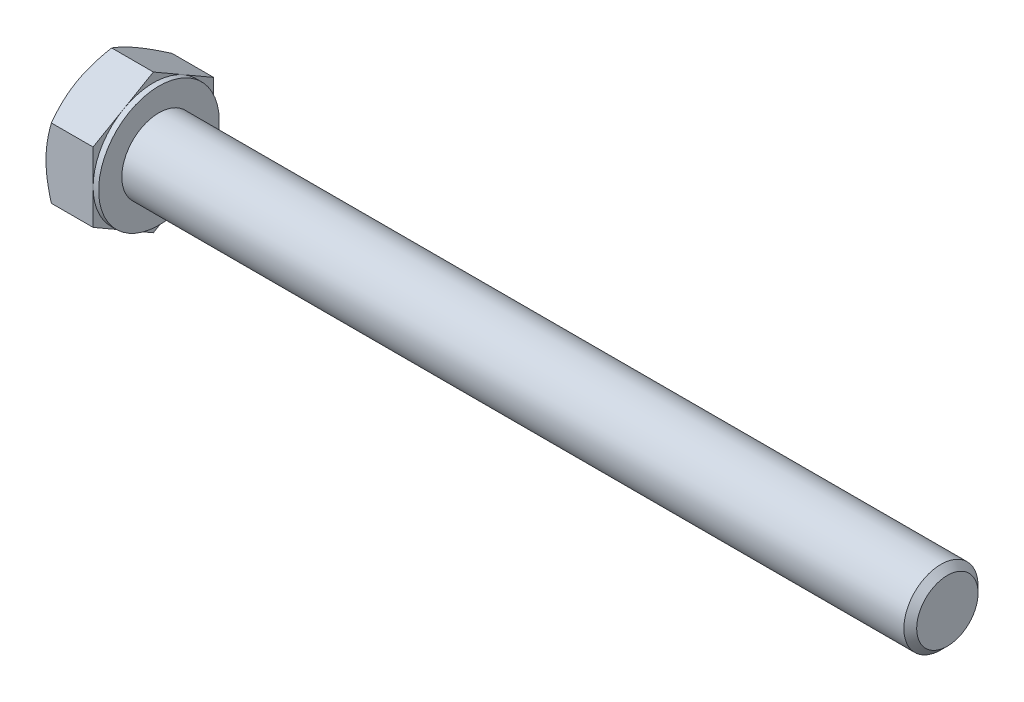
ISO-10303-21;
HEADER;
FILE_DESCRIPTION(('STEP AP214'),'2;1');
FILE_NAME('part.step','',(''),(''),'','','');
FILE_SCHEMA(('AUTOMOTIVE_DESIGN { 1 0 10303 214 1 1 1 1 }'));
ENDSEC;
DATA;
#1=APPLICATION_CONTEXT('core data for automotive mechanical design processes');
#2=APPLICATION_PROTOCOL_DEFINITION('international standard','automotive_design',2000,#1);
#3=PRODUCT_CONTEXT('',#1,'mechanical');
#4=PRODUCT('Part','Part','',(#3));
#5=PRODUCT_RELATED_PRODUCT_CATEGORY('part','',(#4));
#6=PRODUCT_DEFINITION_FORMATION('','',#4);
#7=PRODUCT_DEFINITION_CONTEXT('part definition',#1,'design');
#8=PRODUCT_DEFINITION('design','',#6,#7);
#9=PRODUCT_DEFINITION_SHAPE('','',#8);
#10=(LENGTH_UNIT() NAMED_UNIT(*) SI_UNIT(.MILLI.,.METRE.));
#11=(NAMED_UNIT(*) PLANE_ANGLE_UNIT() SI_UNIT($,.RADIAN.));
#12=(NAMED_UNIT(*) SI_UNIT($,.STERADIAN.) SOLID_ANGLE_UNIT());
#13=UNCERTAINTY_MEASURE_WITH_UNIT(LENGTH_MEASURE(1.E-05),#10,'distance_accuracy_value','');
#14=(GEOMETRIC_REPRESENTATION_CONTEXT(3) GLOBAL_UNCERTAINTY_ASSIGNED_CONTEXT((#13)) GLOBAL_UNIT_ASSIGNED_CONTEXT((#10,
#11,#12)) REPRESENTATION_CONTEXT('',''));
#15=CARTESIAN_POINT('',(0.,0.,0.));
#16=DIRECTION('',(0.,0.,1.));
#17=DIRECTION('',(1.,0.,0.));
#18=AXIS2_PLACEMENT_3D('',#15,#16,#17);
#19=CARTESIAN_POINT('',(5.675,7.50555349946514,0.));
#20=DIRECTION('',(1.,0.,0.));
#21=DIRECTION('',(0.,0.,-1.));
#22=AXIS2_PLACEMENT_3D('',#19,#20,#21);
#23=PLANE('',#22);
#24=CARTESIAN_POINT('',(5.675,0.,0.));
#25=DIRECTION('',(1.,0.,0.));
#26=DIRECTION('',(0.,0.,-1.));
#27=AXIS2_PLACEMENT_3D('',#24,#25,#26);
#28=CIRCLE('',#27,4.);
#29=CARTESIAN_POINT('',(5.675,0.,-4.));
#30=VERTEX_POINT('',#29);
#31=EDGE_CURVE('E269',#30,#30,#28,.F.);
#32=ORIENTED_EDGE('',*,*,#31,.T.);
#33=EDGE_LOOP('',(#32));
#34=FACE_BOUND('',#33,.T.);
#35=CARTESIAN_POINT('',(5.675,0.,0.));
#36=DIRECTION('',(1.,0.,0.));
#37=DIRECTION('',(0.,0.,-1.));
#38=AXIS2_PLACEMENT_3D('',#35,#36,#37);
#39=CIRCLE('',#38,6.5);
#40=CARTESIAN_POINT('',(5.675,0.,-6.5));
#41=VERTEX_POINT('',#40);
#42=EDGE_CURVE('E288',#41,#41,#39,.T.);
#43=ORIENTED_EDGE('',*,*,#42,.T.);
#44=EDGE_LOOP('',(#43));
#45=FACE_BOUND('',#44,.T.);
#46=ADVANCED_FACE('F31',(#34,#45),#23,.T.);
#47=CARTESIAN_POINT('',(0.,0.,0.));
#48=DIRECTION('',(-1.,0.,0.));
#49=DIRECTION('',(0.,0.,1.));
#50=AXIS2_PLACEMENT_3D('',#47,#48,#49);
#51=CYLINDRICAL_SURFACE('',#50,4.);
#52=ORIENTED_EDGE('',*,*,#31,.F.);
#53=EDGE_LOOP('',(#52));
#54=FACE_BOUND('',#53,.T.);
#55=CARTESIAN_POINT('',(89.9845,0.,0.));
#56=DIRECTION('',(-1.,0.,0.));
#57=DIRECTION('',(0.,0.,1.));
#58=AXIS2_PLACEMENT_3D('',#55,#56,#57);
#59=CIRCLE('',#58,4.);
#60=CARTESIAN_POINT('',(89.9845,0.,4.));
#61=VERTEX_POINT('',#60);
#62=EDGE_CURVE('E266',#61,#61,#59,.T.);
#63=ORIENTED_EDGE('',*,*,#62,.T.);
#64=EDGE_LOOP('',(#63));
#65=FACE_BOUND('',#64,.T.);
#66=ADVANCED_FACE('F240',(#54,#65),#51,.T.);
#67=CARTESIAN_POINT('',(90.675,0.,0.));
#68=DIRECTION('',(-1.,0.,0.));
#69=DIRECTION('',(0.,0.,1.));
#70=AXIS2_PLACEMENT_3D('',#67,#68,#69);
#71=CONICAL_SURFACE('',#70,3.3095,0.785398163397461);
#72=ORIENTED_EDGE('',*,*,#62,.F.);
#73=EDGE_LOOP('',(#72));
#74=FACE_BOUND('',#73,.T.);
#75=CARTESIAN_POINT('',(90.675,0.,0.));
#76=DIRECTION('',(-1.,0.,0.));
#77=DIRECTION('',(0.,0.,1.));
#78=AXIS2_PLACEMENT_3D('',#75,#76,#77);
#79=CIRCLE('',#78,3.3095);
#80=CARTESIAN_POINT('',(90.675,0.,3.3095));
#81=VERTEX_POINT('',#80);
#82=EDGE_CURVE('E264',#81,#81,#79,.T.);
#83=ORIENTED_EDGE('',*,*,#82,.T.);
#84=EDGE_LOOP('',(#83));
#85=FACE_BOUND('',#84,.T.);
#86=ADVANCED_FACE('F245',(#74,#85),#71,.T.);
#87=CARTESIAN_POINT('',(90.675,0.,0.));
#88=DIRECTION('',(-1.,0.,0.));
#89=DIRECTION('',(0.,0.,1.));
#90=AXIS2_PLACEMENT_3D('',#87,#88,#89);
#91=PLANE('',#90);
#92=ORIENTED_EDGE('',*,*,#82,.F.);
#93=EDGE_LOOP('',(#92));
#94=FACE_BOUND('',#93,.T.);
#95=ADVANCED_FACE('F252',(#94),#91,.F.);
#96=CARTESIAN_POINT('',(5.075,6.5,0.));
#97=DIRECTION('',(1.,0.,0.));
#98=DIRECTION('',(0.,0.,-1.));
#99=AXIS2_PLACEMENT_3D('',#96,#97,#98);
#100=PLANE('',#99);
#101=DIRECTION('',(0.,0.500000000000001,0.866025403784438));
#102=VECTOR('',#101,1.);
#103=CARTESIAN_POINT('',(5.075,3.75277674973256,-6.5));
#104=LINE('',#103,#102);
#105=CARTESIAN_POINT('',(5.075,3.75277674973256,-6.5));
#106=VERTEX_POINT('',#105);
#107=CARTESIAN_POINT('',(5.075,5.62916512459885,-3.25000000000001));
#108=VERTEX_POINT('',#107);
#109=EDGE_CURVE('E164',#106,#108,#104,.T.);
#110=ORIENTED_EDGE('',*,*,#109,.T.);
#111=CARTESIAN_POINT('',(5.075,0.,0.));
#112=DIRECTION('',(-1.,0.,0.));
#113=DIRECTION('',(0.,0.,1.));
#114=AXIS2_PLACEMENT_3D('',#111,#112,#113);
#115=CIRCLE('',#114,6.5);
#116=CARTESIAN_POINT('',(5.075,0.,-6.5));
#117=VERTEX_POINT('',#116);
#118=EDGE_CURVE('E47',#108,#117,#115,.T.);
#119=ORIENTED_EDGE('',*,*,#118,.T.);
#120=DIRECTION('',(0.,1.,0.));
#121=VECTOR('',#120,1.);
#122=CARTESIAN_POINT('',(5.075,3.75277674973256,-6.5));
#123=LINE('',#122,#121);
#124=EDGE_CURVE('E36',#117,#106,#123,.T.);
#125=ORIENTED_EDGE('',*,*,#124,.T.);
#126=EDGE_LOOP('',(#110,#119,#125));
#127=FACE_BOUND('',#126,.T.);
#128=ADVANCED_FACE('F255',(#127),#100,.T.);
#129=CARTESIAN_POINT('',(5.075,7.50555349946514,0.));
#130=VERTEX_POINT('',#129);
#131=EDGE_CURVE('E162',#108,#130,#104,.T.);
#132=ORIENTED_EDGE('',*,*,#131,.T.);
#133=DIRECTION('',(0.,-0.500000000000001,0.866025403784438));
#134=VECTOR('',#133,1.);
#135=CARTESIAN_POINT('',(5.075,7.50555349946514,0.));
#136=LINE('',#135,#134);
#137=CARTESIAN_POINT('',(5.075,5.62916512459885,3.25));
#138=VERTEX_POINT('',#137);
#139=EDGE_CURVE('E161',#130,#138,#136,.T.);
#140=ORIENTED_EDGE('',*,*,#139,.T.);
#141=EDGE_CURVE('E150',#138,#108,#115,.T.);
#142=ORIENTED_EDGE('',*,*,#141,.T.);
#143=EDGE_LOOP('',(#132,#140,#142));
#144=FACE_BOUND('',#143,.T.);
#145=ADVANCED_FACE('F260',(#144),#100,.T.);
#146=CARTESIAN_POINT('',(5.075,3.75277674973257,6.5));
#147=VERTEX_POINT('',#146);
#148=EDGE_CURVE('E129',#138,#147,#136,.T.);
#149=ORIENTED_EDGE('',*,*,#148,.T.);
#150=DIRECTION('',(0.,-1.,0.));
#151=VECTOR('',#150,1.);
#152=CARTESIAN_POINT('',(5.075,3.75277674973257,6.5));
#153=LINE('',#152,#151);
#154=CARTESIAN_POINT('',(5.075,0.,6.5));
#155=VERTEX_POINT('',#154);
#156=EDGE_CURVE('E123',#147,#155,#153,.T.);
#157=ORIENTED_EDGE('',*,*,#156,.T.);
#158=EDGE_CURVE('E127',#155,#138,#115,.T.);
#159=ORIENTED_EDGE('',*,*,#158,.T.);
#160=EDGE_LOOP('',(#149,#157,#159));
#161=FACE_BOUND('',#160,.T.);
#162=ADVANCED_FACE('F125',(#161),#100,.T.);
#163=CARTESIAN_POINT('',(5.075,-3.75277674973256,6.5));
#164=VERTEX_POINT('',#163);
#165=EDGE_CURVE('E133',#155,#164,#153,.T.);
#166=ORIENTED_EDGE('',*,*,#165,.T.);
#167=DIRECTION('',(0.,-0.500000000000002,-0.866025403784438));
#168=VECTOR('',#167,1.);
#169=CARTESIAN_POINT('',(5.075,-7.50555349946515,0.));
#170=LINE('',#169,#168);
#171=CARTESIAN_POINT('',(5.075,-5.62916512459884,3.25000000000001));
#172=VERTEX_POINT('',#171);
#173=EDGE_CURVE('E140',#164,#172,#170,.T.);
#174=ORIENTED_EDGE('',*,*,#173,.T.);
#175=EDGE_CURVE('E137',#172,#155,#115,.T.);
#176=ORIENTED_EDGE('',*,*,#175,.T.);
#177=EDGE_LOOP('',(#166,#174,#176));
#178=FACE_BOUND('',#177,.T.);
#179=ADVANCED_FACE('F138',(#178),#100,.T.);
#180=CARTESIAN_POINT('',(5.075,-7.50555349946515,0.));
#181=VERTEX_POINT('',#180);
#182=EDGE_CURVE('E156',#172,#181,#170,.T.);
#183=ORIENTED_EDGE('',*,*,#182,.T.);
#184=DIRECTION('',(0.,0.5,-0.866025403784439));
#185=VECTOR('',#184,1.);
#186=CARTESIAN_POINT('',(5.075,-3.75277674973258,-6.5));
#187=LINE('',#186,#185);
#188=CARTESIAN_POINT('',(5.075,-5.62916512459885,-3.25));
#189=VERTEX_POINT('',#188);
#190=EDGE_CURVE('E324',#181,#189,#187,.T.);
#191=ORIENTED_EDGE('',*,*,#190,.T.);
#192=EDGE_CURVE('E144',#189,#172,#115,.T.);
#193=ORIENTED_EDGE('',*,*,#192,.T.);
#194=EDGE_LOOP('',(#183,#191,#193));
#195=FACE_BOUND('',#194,.T.);
#196=ADVANCED_FACE('F329',(#195),#100,.T.);
#197=CARTESIAN_POINT('',(5.075,-3.75277674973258,-6.5));
#198=VERTEX_POINT('',#197);
#199=EDGE_CURVE('E151',#189,#198,#187,.T.);
#200=ORIENTED_EDGE('',*,*,#199,.T.);
#201=EDGE_CURVE('E11',#198,#117,#123,.T.);
#202=ORIENTED_EDGE('',*,*,#201,.T.);
#203=EDGE_CURVE('E342',#117,#189,#115,.T.);
#204=ORIENTED_EDGE('',*,*,#203,.T.);
#205=EDGE_LOOP('',(#200,#202,#204));
#206=FACE_BOUND('',#205,.T.);
#207=ADVANCED_FACE('F261',(#206),#100,.T.);
#208=CARTESIAN_POINT('',(0.,0.,0.));
#209=DIRECTION('',(-1.,0.,0.));
#210=DIRECTION('',(0.,0.,1.));
#211=AXIS2_PLACEMENT_3D('',#208,#209,#210);
#212=CYLINDRICAL_SURFACE('',#211,6.5);
#213=ORIENTED_EDGE('',*,*,#118,.F.);
#214=ORIENTED_EDGE('',*,*,#141,.F.);
#215=ORIENTED_EDGE('',*,*,#158,.F.);
#216=ORIENTED_EDGE('',*,*,#175,.F.);
#217=ORIENTED_EDGE('',*,*,#192,.F.);
#218=ORIENTED_EDGE('',*,*,#203,.F.);
#219=EDGE_LOOP('',(#213,#214,#215,#216,#217,#218));
#220=FACE_BOUND('',#219,.T.);
#221=ORIENTED_EDGE('',*,*,#42,.F.);
#222=EDGE_LOOP('',(#221));
#223=FACE_BOUND('',#222,.T.);
#224=ADVANCED_FACE('F147',(#220,#223),#212,.T.);
#225=CARTESIAN_POINT('',(0.,7.50555349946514,0.));
#226=DIRECTION('',(1.,0.,0.));
#227=DIRECTION('',(0.,0.,-1.));
#228=AXIS2_PLACEMENT_3D('',#225,#226,#227);
#229=PLANE('',#228);
#230=CARTESIAN_POINT('',(0.,0.,0.));
#231=DIRECTION('',(1.,0.,0.));
#232=DIRECTION('',(0.,0.,-1.));
#233=AXIS2_PLACEMENT_3D('',#230,#231,#232);
#234=CIRCLE('',#233,6.5);
#235=CARTESIAN_POINT('',(0.,0.,-6.5));
#236=VERTEX_POINT('',#235);
#237=CARTESIAN_POINT('',(0.,5.62916512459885,-3.25000000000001));
#238=VERTEX_POINT('',#237);
#239=EDGE_CURVE('E287',#236,#238,#234,.T.);
#240=ORIENTED_EDGE('',*,*,#239,.F.);
#241=CARTESIAN_POINT('',(0.,-5.62916512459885,-3.25));
#242=VERTEX_POINT('',#241);
#243=EDGE_CURVE('E284',#242,#236,#234,.T.);
#244=ORIENTED_EDGE('',*,*,#243,.F.);
#245=CARTESIAN_POINT('',(0.,-5.62916512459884,3.25000000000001));
#246=VERTEX_POINT('',#245);
#247=EDGE_CURVE('E286',#246,#242,#234,.T.);
#248=ORIENTED_EDGE('',*,*,#247,.F.);
#249=CARTESIAN_POINT('',(0.,0.,6.5));
#250=VERTEX_POINT('',#249);
#251=EDGE_CURVE('E296',#250,#246,#234,.T.);
#252=ORIENTED_EDGE('',*,*,#251,.F.);
#253=CARTESIAN_POINT('',(0.,0.,0.));
#254=DIRECTION('',(-1.,0.,0.));
#255=DIRECTION('',(0.,0.,1.));
#256=AXIS2_PLACEMENT_3D('',#253,#254,#255);
#257=CIRCLE('',#256,6.5);
#258=CARTESIAN_POINT('',(0.,5.62916512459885,3.25));
#259=VERTEX_POINT('',#258);
#260=EDGE_CURVE('E165',#250,#259,#257,.T.);
#261=ORIENTED_EDGE('',*,*,#260,.T.);
#262=EDGE_CURVE('E291',#238,#259,#234,.T.);
#263=ORIENTED_EDGE('',*,*,#262,.F.);
#264=EDGE_LOOP('',(#240,#244,#248,#252,#261,#263));
#265=FACE_BOUND('',#264,.T.);
#266=ADVANCED_FACE('F194',(#265),#229,.F.);
#267=CARTESIAN_POINT('',(0.,0.,0.));
#268=DIRECTION('',(1.,0.,0.));
#269=DIRECTION('',(0.,0.,-1.));
#270=AXIS2_PLACEMENT_3D('',#267,#268,#269);
#271=CONICAL_SURFACE('',#270,6.5,1.0471975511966);
#272=CARTESIAN_POINT('',(0.580623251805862,3.75266127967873,6.5002));
#273=CARTESIAN_POINT('',(0.53300442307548,3.8351516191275,6.35732254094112));
#274=CARTESIAN_POINT('',(0.487546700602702,3.91794952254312,6.21391236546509));
#275=CARTESIAN_POINT('',(0.401548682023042,4.08421773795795,5.9259273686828));
#276=CARTESIAN_POINT('',(0.361010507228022,4.16768832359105,5.78135207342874));
#277=CARTESIAN_POINT('',(0.247571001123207,4.41943655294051,5.34531134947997));
#278=CARTESIAN_POINT('',(0.183047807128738,4.58870793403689,5.05212471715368));
#279=CARTESIAN_POINT('',(0.107386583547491,4.84201947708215,4.61337625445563));
#280=CARTESIAN_POINT('',(0.0858328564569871,4.92530276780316,4.46912536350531));
#281=CARTESIAN_POINT('',(0.0496903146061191,5.09224566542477,4.17997178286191));
#282=CARTESIAN_POINT('',(0.0351008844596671,5.17590523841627,4.03506915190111));
#283=CARTESIAN_POINT('',(0.0132587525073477,5.34336968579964,3.74501222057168));
#284=CARTESIAN_POINT('',(0.00599772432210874,5.427174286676,3.59985839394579));
#285=CARTESIAN_POINT('',(-0.00103969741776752,5.59485627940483,3.30942466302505));
#286=CARTESIAN_POINT('',(-0.000816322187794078,5.6787336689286,3.16414476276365));
#287=CARTESIAN_POINT('',(0.0100834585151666,5.90853103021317,2.76612405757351));
#288=CARTESIAN_POINT('',(0.0283818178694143,6.05437578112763,2.51351353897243));
#289=CARTESIAN_POINT('',(0.0864063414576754,6.34509659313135,2.00997032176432));
#290=CARTESIAN_POINT('',(0.126152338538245,6.48997163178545,1.75903939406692));
#291=CARTESIAN_POINT('',(0.225505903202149,6.78127752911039,1.25448277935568));
#292=CARTESIAN_POINT('',(0.285534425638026,6.92767163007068,1.00092075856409));
#293=CARTESIAN_POINT('',(0.421774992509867,7.21827667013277,0.497578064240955));
#294=CARTESIAN_POINT('',(0.497955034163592,7.36249133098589,0.247790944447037));
#295=CARTESIAN_POINT('',(0.580623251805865,7.50566896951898,-0.000200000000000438));
#296=B_SPLINE_CURVE_WITH_KNOTS('',3,(#272,#273,#274,#275,#276,#277,#278,#279,#280,#281,#282,
#283,#284,#285,#286,#287,#288,#289,#290,#291,#292,#293,#294,#295),.UNSPECIFIED.,.F.,.F.,(4,2,2,
2,2,2,2,2,2,2,2,4),(0.,0.515105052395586,1.03043143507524,2.06322554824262,2.56697389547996,
3.07067772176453,3.57380860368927,4.07692394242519,4.9527935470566,5.82947446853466,
6.72559912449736,7.61996451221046),.UNSPECIFIED.);
#297=CARTESIAN_POINT('',(0.580556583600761,7.50555349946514,0.));
#298=VERTEX_POINT('',#297);
#299=EDGE_CURVE('E212',#259,#298,#296,.T.);
#300=ORIENTED_EDGE('',*,*,#299,.T.);
#301=CARTESIAN_POINT('',(0.580623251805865,7.50566896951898,0.0002));
#302=CARTESIAN_POINT('',(0.533004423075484,7.4231786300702,-0.14267745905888));
#303=CARTESIAN_POINT('',(0.487546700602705,7.34038072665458,-0.286087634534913));
#304=CARTESIAN_POINT('',(0.401548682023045,7.17411251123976,-0.574072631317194));
#305=CARTESIAN_POINT('',(0.361010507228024,7.09064192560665,-0.718647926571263));
#306=CARTESIAN_POINT('',(0.247571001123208,6.83889369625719,-1.15468865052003));
#307=CARTESIAN_POINT('',(0.183047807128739,6.66962231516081,-1.44787528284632));
#308=CARTESIAN_POINT('',(0.107386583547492,6.41631077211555,-1.88662374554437));
#309=CARTESIAN_POINT('',(0.0858328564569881,6.33302748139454,-2.03087463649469));
#310=CARTESIAN_POINT('',(0.0496903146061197,6.16608458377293,-2.32002821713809));
#311=CARTESIAN_POINT('',(0.0351008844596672,6.08242501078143,-2.46493084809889));
#312=CARTESIAN_POINT('',(0.0132587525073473,5.91496056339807,-2.75498777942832));
#313=CARTESIAN_POINT('',(0.00599772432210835,5.8311559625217,-2.90014160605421));
#314=CARTESIAN_POINT('',(-0.00103969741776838,5.66347396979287,-3.19057533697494));
#315=CARTESIAN_POINT('',(-0.000816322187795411,5.5795965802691,-3.33585523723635));
#316=CARTESIAN_POINT('',(0.0100834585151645,5.34979921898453,-3.73387594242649));
#317=CARTESIAN_POINT('',(0.0283818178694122,5.20395446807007,-3.98648646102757));
#318=CARTESIAN_POINT('',(0.0864063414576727,4.91323365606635,-4.49002967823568));
#319=CARTESIAN_POINT('',(0.126152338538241,4.76835861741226,-4.74096060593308));
#320=CARTESIAN_POINT('',(0.225505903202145,4.47705272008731,-5.24551722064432));
#321=CARTESIAN_POINT('',(0.285534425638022,4.33065861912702,-5.49907924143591));
#322=CARTESIAN_POINT('',(0.421774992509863,4.04005357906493,-6.00242193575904));
#323=CARTESIAN_POINT('',(0.497955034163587,3.89583891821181,-6.25220905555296));
#324=CARTESIAN_POINT('',(0.58062325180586,3.75266127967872,-6.5002));
#325=B_SPLINE_CURVE_WITH_KNOTS('',3,(#301,#302,#303,#304,#305,#306,#307,#308,#309,#310,#311,
#312,#313,#314,#315,#316,#317,#318,#319,#320,#321,#322,#323,#324),.UNSPECIFIED.,.F.,.F.,(4,2,2,
2,2,2,2,2,2,2,2,4),(0.,0.515105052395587,1.03043143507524,2.06322554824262,2.56697389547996,
3.07067772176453,3.57380860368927,4.0769239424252,4.9527935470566,5.82947446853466,
6.72559912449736,7.61996451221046),.UNSPECIFIED.);
#326=EDGE_CURVE('E55',#298,#238,#325,.T.);
#327=ORIENTED_EDGE('',*,*,#326,.T.);
#328=ORIENTED_EDGE('',*,*,#262,.T.);
#329=EDGE_LOOP('',(#300,#327,#328));
#330=FACE_BOUND('',#329,.T.);
#331=ADVANCED_FACE('F338',(#330),#271,.T.);
#332=CARTESIAN_POINT('',(3.18835311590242,-10.1137456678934,6.5));
#333=CARTESIAN_POINT('',(3.05034774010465,-9.82952666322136,6.5));
#334=CARTESIAN_POINT('',(2.91365616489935,-9.54465869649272,6.5));
#335=CARTESIAN_POINT('',(2.64363899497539,-8.9732797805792,6.5));
#336=CARTESIAN_POINT('',(2.51031392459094,-8.6867685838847,6.5));
#337=CARTESIAN_POINT('',(2.24710473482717,-8.11029837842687,6.5));
#338=CARTESIAN_POINT('',(2.11724300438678,-7.8203291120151,6.5));
#339=CARTESIAN_POINT('',(1.86279082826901,-7.23809541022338,6.5));
#340=CARTESIAN_POINT('',(1.73820013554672,-6.94583108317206,6.5));
#341=CARTESIAN_POINT('',(1.4917668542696,-6.34906440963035,6.5));
#342=CARTESIAN_POINT('',(1.37014257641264,-6.04447142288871,6.5));
#343=CARTESIAN_POINT('',(1.13601865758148,-5.43173420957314,6.5));
#344=CARTESIAN_POINT('',(1.02352003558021,-5.12358959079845,6.5));
#345=CARTESIAN_POINT('',(0.810575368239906,-4.50382569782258,6.5));
#346=CARTESIAN_POINT('',(0.710105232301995,-4.19221478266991,6.5));
#347=CARTESIAN_POINT('',(0.524420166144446,-3.56452019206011,6.5));
#348=CARTESIAN_POINT('',(0.439200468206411,-3.24843794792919,6.5));
#349=CARTESIAN_POINT('',(0.288524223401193,-2.61335465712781,6.5));
#350=CARTESIAN_POINT('',(0.222961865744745,-2.29437912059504,6.5));
#351=CARTESIAN_POINT('',(0.115312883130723,-1.65238219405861,6.5));
#352=CARTESIAN_POINT('',(0.0732239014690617,-1.32936121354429,6.5));
#353=CARTESIAN_POINT('',(0.0304887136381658,-0.845231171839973,6.5));
#354=CARTESIAN_POINT('',(0.0196493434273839,-0.684982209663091,6.5));
#355=CARTESIAN_POINT('',(0.00475298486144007,-0.36416234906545,6.5));
#356=CARTESIAN_POINT('',(0.000695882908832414,-0.20359145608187,6.5));
#357=CARTESIAN_POINT('',(-0.000531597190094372,0.117577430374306,6.5));
#358=CARTESIAN_POINT('',(0.00229809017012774,0.278175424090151,6.5));
#359=CARTESIAN_POINT('',(0.014772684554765,0.599108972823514,6.5));
#360=CARTESIAN_POINT('',(0.0244179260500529,0.759444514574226,6.5));
#361=CARTESIAN_POINT('',(0.0554961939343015,1.14369946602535,6.5));
#362=CARTESIAN_POINT('',(0.0801030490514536,1.36736763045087,6.5));
#363=CARTESIAN_POINT('',(0.14124653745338,1.81305591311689,6.5));
#364=CARTESIAN_POINT('',(0.177784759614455,2.03507580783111,6.5));
#365=CARTESIAN_POINT('',(0.303360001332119,2.69839633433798,6.5));
#366=CARTESIAN_POINT('',(0.4083358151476,3.1367201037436,6.5));
#367=CARTESIAN_POINT('',(0.590564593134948,3.79232112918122,6.5));
#368=CARTESIAN_POINT('',(0.6563131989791,4.01299150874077,6.5));
#369=CARTESIAN_POINT('',(0.794681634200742,4.45218859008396,6.5));
#370=CARTESIAN_POINT('',(0.867301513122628,4.67071527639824,6.5));
#371=CARTESIAN_POINT('',(1.01824353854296,5.10569490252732,6.5));
#372=CARTESIAN_POINT('',(1.0965638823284,5.32214847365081,6.5));
#373=CARTESIAN_POINT('',(1.25798086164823,5.75325725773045,6.5));
#374=CARTESIAN_POINT('',(1.34107741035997,5.96791250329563,6.5));
#375=CARTESIAN_POINT('',(1.56029019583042,6.51888445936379,6.5));
#376=CARTESIAN_POINT('',(1.69936356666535,6.85402316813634,6.5));
#377=CARTESIAN_POINT('',(1.98501958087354,7.521095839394,6.5));
#378=CARTESIAN_POINT('',(2.13160288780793,7.85302951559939,6.5));
#379=CARTESIAN_POINT('',(2.43059748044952,8.51437865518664,6.5));
#380=CARTESIAN_POINT('',(2.5830105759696,8.843793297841,6.5));
#381=CARTESIAN_POINT('',(2.89234869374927,9.50047798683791,6.5));
#382=CARTESIAN_POINT('',(3.04927357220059,9.82774810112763,6.5));
#383=CARTESIAN_POINT('',(3.36692013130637,10.4809971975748,6.5));
#384=CARTESIAN_POINT('',(3.52764676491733,10.8069737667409,6.5));
#385=CARTESIAN_POINT('',(3.85198555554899,11.4574882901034,6.5));
#386=CARTESIAN_POINT('',(4.01559773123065,11.7820262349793,6.5));
#387=CARTESIAN_POINT('',(4.50986185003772,12.7537468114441,6.5));
#388=CARTESIAN_POINT('',(4.8439999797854,13.3991555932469,6.5));
#389=CARTESIAN_POINT('',(5.48575990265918,14.6239779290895,6.5));
#390=CARTESIAN_POINT('',(5.79279643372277,15.2036995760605,6.5));
#391=CARTESIAN_POINT('',(6.41069188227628,16.3611382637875,6.5));
#392=CARTESIAN_POINT('',(6.72155099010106,16.9388552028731,6.5));
#393=CARTESIAN_POINT('',(7.34519775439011,18.0910273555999,6.5));
#394=CARTESIAN_POINT('',(7.65797694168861,18.6654871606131,6.5));
#395=CARTESIAN_POINT('',(8.28574397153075,19.8131486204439,6.5));
#396=CARTESIAN_POINT('',(8.60073166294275,20.3863503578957,6.5));
#397=CARTESIAN_POINT('',(8.91652967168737,20.9591024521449,6.5));
#398=B_SPLINE_CURVE_WITH_KNOTS('',3,(#332,#333,#334,#335,#336,#337,#338,#339,#340,#341,#342,
#343,#344,#345,#346,#347,#348,#349,#350,#351,#352,#353,#354,#355,#356,#357,#358,#359,#360,#361,
#362,#363,#364,#365,#366,#367,#368,#369,#370,#371,#372,#373,#374,#375,#376,#377,#378,#379,#380,
#381,#382,#383,#384,#385,#386,#387,#388,#389,#390,#391,#392,#393,#394,#395,#396,#397),
.UNSPECIFIED.,.F.,.F.,(4,2,2,2,2,2,2,2,2,2,2,2,2,2,2,2,2,2,2,2,2,2,2,2,2,2,2,2,2,2,2,2,4),(0.,
0.94786866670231,1.89588406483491,2.84900320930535,3.80207763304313,4.78589774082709,
5.76982755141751,6.75175256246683,7.73337005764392,8.7096047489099,9.68574140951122,
10.1674651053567,10.6491807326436,11.1309009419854,11.6126447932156,12.287317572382,
12.9620802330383,14.312318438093,15.0030310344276,15.6937486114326,16.3842486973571,
17.0747362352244,18.1631508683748,19.2516618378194,20.3405135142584,21.429330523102,
22.5196540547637,23.6099846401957,25.7902468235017,27.7582608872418,29.7263733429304,
31.6886408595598,33.6507753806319),.UNSPECIFIED.);
#399=CARTESIAN_POINT('',(0.580556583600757,3.75277674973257,6.5));
#400=VERTEX_POINT('',#399);
#401=EDGE_CURVE('E224',#250,#400,#398,.T.);
#402=ORIENTED_EDGE('',*,*,#401,.T.);
#403=EDGE_CURVE('E223',#400,#259,#296,.T.);
#404=ORIENTED_EDGE('',*,*,#403,.T.);
#405=ORIENTED_EDGE('',*,*,#260,.F.);
#406=EDGE_LOOP('',(#402,#404,#405));
#407=FACE_BOUND('',#406,.T.);
#408=ADVANCED_FACE('F334',(#407),#271,.T.);
#409=CARTESIAN_POINT('',(0.580556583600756,-3.75277674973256,6.5));
#410=VERTEX_POINT('',#409);
#411=EDGE_CURVE('E267',#410,#250,#398,.T.);
#412=ORIENTED_EDGE('',*,*,#411,.T.);
#413=ORIENTED_EDGE('',*,*,#251,.T.);
#414=CARTESIAN_POINT('',(0.580623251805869,-7.50566896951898,-0.000200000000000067));
#415=CARTESIAN_POINT('',(0.533004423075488,-7.42317863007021,0.14267745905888));
#416=CARTESIAN_POINT('',(0.487546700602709,-7.34038072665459,0.286087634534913));
#417=CARTESIAN_POINT('',(0.401548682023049,-7.17411251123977,0.574072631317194));
#418=CARTESIAN_POINT('',(0.361010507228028,-7.09064192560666,0.718647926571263));
#419=CARTESIAN_POINT('',(0.247571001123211,-6.8388936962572,1.15468865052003));
#420=CARTESIAN_POINT('',(0.183047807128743,-6.66962231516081,1.44787528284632));
#421=CARTESIAN_POINT('',(0.107386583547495,-6.41631077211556,1.88662374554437));
#422=CARTESIAN_POINT('',(0.0858328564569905,-6.33302748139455,2.03087463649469));
#423=CARTESIAN_POINT('',(0.049690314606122,-6.16608458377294,2.32002821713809));
#424=CARTESIAN_POINT('',(0.0351008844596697,-6.08242501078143,2.46493084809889));
#425=CARTESIAN_POINT('',(0.0132587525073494,-5.91496056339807,2.75498777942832));
#426=CARTESIAN_POINT('',(0.00599772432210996,-5.83115596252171,2.90014160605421));
#427=CARTESIAN_POINT('',(-0.00103969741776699,-5.66347396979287,3.19057533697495));
#428=CARTESIAN_POINT('',(-0.000816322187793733,-5.5795965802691,3.33585523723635));
#429=CARTESIAN_POINT('',(0.0100834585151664,-5.34979921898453,3.73387594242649));
#430=CARTESIAN_POINT('',(0.0283818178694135,-5.20395446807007,3.98648646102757));
#431=CARTESIAN_POINT('',(0.0864063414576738,-4.91323365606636,4.49002967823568));
#432=CARTESIAN_POINT('',(0.126152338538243,-4.76835861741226,4.74096060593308));
#433=CARTESIAN_POINT('',(0.225505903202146,-4.47705272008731,5.24551722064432));
#434=CARTESIAN_POINT('',(0.285534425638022,-4.33065861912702,5.49907924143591));
#435=CARTESIAN_POINT('',(0.421774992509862,-4.04005357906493,6.00242193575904));
#436=CARTESIAN_POINT('',(0.497955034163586,-3.89583891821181,6.25220905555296));
#437=CARTESIAN_POINT('',(0.580623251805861,-3.75266127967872,6.5002));
#438=B_SPLINE_CURVE_WITH_KNOTS('',3,(#414,#415,#416,#417,#418,#419,#420,#421,#422,#423,#424,
#425,#426,#427,#428,#429,#430,#431,#432,#433,#434,#435,#436,#437),.UNSPECIFIED.,.F.,.F.,(4,2,2,
2,2,2,2,2,2,2,2,4),(0.,0.515105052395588,1.03043143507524,2.06322554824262,2.56697389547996,
3.07067772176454,3.57380860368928,4.0769239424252,4.9527935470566,5.82947446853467,
6.72559912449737,7.61996451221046),.UNSPECIFIED.);
#439=EDGE_CURVE('E214',#246,#410,#438,.T.);
#440=ORIENTED_EDGE('',*,*,#439,.T.);
#441=EDGE_LOOP('',(#412,#413,#440));
#442=FACE_BOUND('',#441,.T.);
#443=ADVANCED_FACE('F183',(#442),#271,.T.);
#444=CARTESIAN_POINT('',(0.580556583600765,-7.50555349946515,0.));
#445=VERTEX_POINT('',#444);
#446=EDGE_CURVE('E207',#445,#246,#438,.T.);
#447=ORIENTED_EDGE('',*,*,#446,.T.);
#448=ORIENTED_EDGE('',*,*,#247,.T.);
#449=CARTESIAN_POINT('',(0.580623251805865,-3.75266127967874,-6.5002));
#450=CARTESIAN_POINT('',(0.533004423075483,-3.83515161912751,-6.35732254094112));
#451=CARTESIAN_POINT('',(0.487546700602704,-3.91794952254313,-6.21391236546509));
#452=CARTESIAN_POINT('',(0.401548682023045,-4.08421773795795,-5.9259273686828));
#453=CARTESIAN_POINT('',(0.361010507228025,-4.16768832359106,-5.78135207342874));
#454=CARTESIAN_POINT('',(0.24757100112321,-4.41943655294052,-5.34531134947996));
#455=CARTESIAN_POINT('',(0.183047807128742,-4.5887079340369,-5.05212471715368));
#456=CARTESIAN_POINT('',(0.107386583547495,-4.84201947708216,-4.61337625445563));
#457=CARTESIAN_POINT('',(0.085832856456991,-4.92530276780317,-4.46912536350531));
#458=CARTESIAN_POINT('',(0.0496903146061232,-5.09224566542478,-4.17997178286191));
#459=CARTESIAN_POINT('',(0.0351008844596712,-5.17590523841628,-4.03506915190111));
#460=CARTESIAN_POINT('',(0.0132587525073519,-5.34336968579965,-3.74501222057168));
#461=CARTESIAN_POINT('',(0.00599772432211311,-5.42717428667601,-3.59985839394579));
#462=CARTESIAN_POINT('',(-0.00103969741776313,-5.59485627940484,-3.30942466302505));
#463=CARTESIAN_POINT('',(-0.000816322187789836,-5.67873366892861,-3.16414476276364));
#464=CARTESIAN_POINT('',(0.0100834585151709,-5.90853103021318,-2.76612405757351));
#465=CARTESIAN_POINT('',(0.028381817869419,-6.05437578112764,-2.51351353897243));
#466=CARTESIAN_POINT('',(0.0864063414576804,-6.34509659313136,-2.00997032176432));
#467=CARTESIAN_POINT('',(0.12615233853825,-6.48997163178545,-1.75903939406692));
#468=CARTESIAN_POINT('',(0.225505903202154,-6.78127752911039,-1.25448277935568));
#469=CARTESIAN_POINT('',(0.28553442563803,-6.92767163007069,-1.00092075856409));
#470=CARTESIAN_POINT('',(0.421774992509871,-7.21827667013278,-0.497578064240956));
#471=CARTESIAN_POINT('',(0.497955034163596,-7.3624913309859,-0.247790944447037));
#472=CARTESIAN_POINT('',(0.580623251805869,-7.50566896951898,0.000199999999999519));
#473=B_SPLINE_CURVE_WITH_KNOTS('',3,(#449,#450,#451,#452,#453,#454,#455,#456,#457,#458,#459,
#460,#461,#462,#463,#464,#465,#466,#467,#468,#469,#470,#471,#472),.UNSPECIFIED.,.F.,.F.,(4,2,2,
2,2,2,2,2,2,2,2,4),(0.,0.515105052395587,1.03043143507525,2.06322554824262,2.56697389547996,
3.07067772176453,3.57380860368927,4.0769239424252,4.9527935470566,5.82947446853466,
6.72559912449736,7.61996451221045),.UNSPECIFIED.);
#474=EDGE_CURVE('E213',#242,#445,#473,.T.);
#475=ORIENTED_EDGE('',*,*,#474,.T.);
#476=EDGE_LOOP('',(#447,#448,#475));
#477=FACE_BOUND('',#476,.T.);
#478=ADVANCED_FACE('F305',(#477),#271,.T.);
#479=CARTESIAN_POINT('',(0.580556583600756,3.75277674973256,-6.5));
#480=VERTEX_POINT('',#479);
#481=EDGE_CURVE('E215',#238,#480,#325,.T.);
#482=ORIENTED_EDGE('',*,*,#481,.T.);
#483=CARTESIAN_POINT('',(3.18835311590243,-10.1137456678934,-6.5));
#484=CARTESIAN_POINT('',(3.05034774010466,-9.82952666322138,-6.5));
#485=CARTESIAN_POINT('',(2.91365616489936,-9.54465869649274,-6.5));
#486=CARTESIAN_POINT('',(2.64363899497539,-8.97327978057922,-6.5));
#487=CARTESIAN_POINT('',(2.51031392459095,-8.68676858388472,-6.5));
#488=CARTESIAN_POINT('',(2.24710473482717,-8.11029837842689,-6.5));
#489=CARTESIAN_POINT('',(2.11724300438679,-7.82032911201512,-6.5));
#490=CARTESIAN_POINT('',(1.86279082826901,-7.2380954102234,-6.5));
#491=CARTESIAN_POINT('',(1.73820013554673,-6.94583108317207,-6.5));
#492=CARTESIAN_POINT('',(1.4917668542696,-6.34906440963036,-6.5));
#493=CARTESIAN_POINT('',(1.37014257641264,-6.04447142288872,-6.5));
#494=CARTESIAN_POINT('',(1.13601865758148,-5.43173420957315,-6.5));
#495=CARTESIAN_POINT('',(1.02352003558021,-5.12358959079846,-6.5));
#496=CARTESIAN_POINT('',(0.810575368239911,-4.5038256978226,-6.5));
#497=CARTESIAN_POINT('',(0.710105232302,-4.19221478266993,-6.5));
#498=CARTESIAN_POINT('',(0.52442016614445,-3.56452019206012,-6.5));
#499=CARTESIAN_POINT('',(0.439200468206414,-3.24843794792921,-6.5));
#500=CARTESIAN_POINT('',(0.288524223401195,-2.61335465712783,-6.5));
#501=CARTESIAN_POINT('',(0.222961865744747,-2.29437912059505,-6.5));
#502=CARTESIAN_POINT('',(0.115312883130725,-1.65238219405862,-6.5));
#503=CARTESIAN_POINT('',(0.0732239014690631,-1.3293612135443,-6.5));
#504=CARTESIAN_POINT('',(0.0304887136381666,-0.845231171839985,-6.5));
#505=CARTESIAN_POINT('',(0.0196493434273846,-0.684982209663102,-6.5));
#506=CARTESIAN_POINT('',(0.00475298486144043,-0.36416234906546,-6.5));
#507=CARTESIAN_POINT('',(0.000695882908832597,-0.20359145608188,-6.5));
#508=CARTESIAN_POINT('',(-0.000531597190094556,0.117577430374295,-6.5));
#509=CARTESIAN_POINT('',(0.00229809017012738,0.278175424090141,-6.5));
#510=CARTESIAN_POINT('',(0.0147726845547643,0.599108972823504,-6.5));
#511=CARTESIAN_POINT('',(0.0244179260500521,0.759444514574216,-6.5));
#512=CARTESIAN_POINT('',(0.0554961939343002,1.14369946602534,-6.5));
#513=CARTESIAN_POINT('',(0.0801030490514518,1.36736763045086,-6.5));
#514=CARTESIAN_POINT('',(0.141246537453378,1.81305591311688,-6.5));
#515=CARTESIAN_POINT('',(0.177784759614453,2.03507580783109,-6.5));
#516=CARTESIAN_POINT('',(0.303360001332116,2.69839633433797,-6.5));
#517=CARTESIAN_POINT('',(0.408335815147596,3.13672010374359,-6.5));
#518=CARTESIAN_POINT('',(0.590564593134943,3.79232112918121,-6.5));
#519=CARTESIAN_POINT('',(0.656313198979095,4.01299150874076,-6.5));
#520=CARTESIAN_POINT('',(0.794681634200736,4.45218859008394,-6.5));
#521=CARTESIAN_POINT('',(0.867301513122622,4.67071527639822,-6.5));
#522=CARTESIAN_POINT('',(1.01824353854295,5.1056949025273,-6.5));
#523=CARTESIAN_POINT('',(1.09656388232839,5.3221484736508,-6.5));
#524=CARTESIAN_POINT('',(1.25798086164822,5.75325725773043,-6.5));
#525=CARTESIAN_POINT('',(1.34107741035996,5.96791250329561,-6.5));
#526=CARTESIAN_POINT('',(1.56029019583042,6.51888445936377,-6.5));
#527=CARTESIAN_POINT('',(1.69936356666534,6.85402316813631,-6.5));
#528=CARTESIAN_POINT('',(1.98501958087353,7.52109583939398,-6.5));
#529=CARTESIAN_POINT('',(2.13160288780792,7.85302951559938,-6.5));
#530=CARTESIAN_POINT('',(2.43059748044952,8.51437865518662,-6.5));
#531=CARTESIAN_POINT('',(2.58301057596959,8.84379329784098,-6.5));
#532=CARTESIAN_POINT('',(2.89234869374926,9.50047798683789,-6.5));
#533=CARTESIAN_POINT('',(3.04927357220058,9.82774810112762,-6.5));
#534=CARTESIAN_POINT('',(3.36692013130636,10.4809971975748,-6.5));
#535=CARTESIAN_POINT('',(3.52764676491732,10.8069737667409,-6.5));
#536=CARTESIAN_POINT('',(3.85198555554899,11.4574882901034,-6.5));
#537=CARTESIAN_POINT('',(4.01559773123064,11.7820262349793,-6.5));
#538=CARTESIAN_POINT('',(4.50986185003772,12.7537468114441,-6.5));
#539=CARTESIAN_POINT('',(4.84399997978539,13.3991555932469,-6.5));
#540=CARTESIAN_POINT('',(5.48575990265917,14.6239779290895,-6.5));
#541=CARTESIAN_POINT('',(5.79279643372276,15.2036995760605,-6.5));
#542=CARTESIAN_POINT('',(6.41069188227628,16.3611382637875,-6.5));
#543=CARTESIAN_POINT('',(6.72155099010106,16.9388552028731,-6.5));
#544=CARTESIAN_POINT('',(7.34519775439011,18.0910273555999,-6.5));
#545=CARTESIAN_POINT('',(7.65797694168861,18.6654871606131,-6.5));
#546=CARTESIAN_POINT('',(8.28574397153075,19.8131486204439,-6.5));
#547=CARTESIAN_POINT('',(8.60073166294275,20.3863503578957,-6.5));
#548=CARTESIAN_POINT('',(8.91652967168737,20.9591024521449,-6.5));
#549=B_SPLINE_CURVE_WITH_KNOTS('',3,(#483,#484,#485,#486,#487,#488,#489,#490,#491,#492,#493,
#494,#495,#496,#497,#498,#499,#500,#501,#502,#503,#504,#505,#506,#507,#508,#509,#510,#511,#512,
#513,#514,#515,#516,#517,#518,#519,#520,#521,#522,#523,#524,#525,#526,#527,#528,#529,#530,#531,
#532,#533,#534,#535,#536,#537,#538,#539,#540,#541,#542,#543,#544,#545,#546,#547,#548),
.UNSPECIFIED.,.F.,.F.,(4,2,2,2,2,2,2,2,2,2,2,2,2,2,2,2,2,2,2,2,2,2,2,2,2,2,2,2,2,2,2,2,4),(0.,
0.947868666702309,1.89588406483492,2.84900320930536,3.80207763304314,4.7858977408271,
5.76982755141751,6.75175256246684,7.73337005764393,8.7096047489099,9.68574140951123,
10.1674651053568,10.6491807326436,11.1309009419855,11.6126447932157,12.287317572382,
12.9620802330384,14.312318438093,15.0030310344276,15.6937486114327,16.3842486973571,
17.0747362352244,18.1631508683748,19.2516618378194,20.3405135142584,21.429330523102,
22.5196540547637,23.6099846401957,25.7902468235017,27.7582608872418,29.7263733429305,
31.6886408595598,33.6507753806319),.UNSPECIFIED.);
#550=EDGE_CURVE('E176',#480,#236,#549,.F.);
#551=ORIENTED_EDGE('',*,*,#550,.T.);
#552=ORIENTED_EDGE('',*,*,#239,.T.);
#553=EDGE_LOOP('',(#482,#551,#552));
#554=FACE_BOUND('',#553,.T.);
#555=ADVANCED_FACE('F319',(#554),#271,.T.);
#556=CARTESIAN_POINT('',(0.580556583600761,-3.75277674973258,-6.5));
#557=VERTEX_POINT('',#556);
#558=EDGE_CURVE('E177',#557,#242,#473,.T.);
#559=ORIENTED_EDGE('',*,*,#558,.T.);
#560=ORIENTED_EDGE('',*,*,#243,.T.);
#561=EDGE_CURVE('E168',#236,#557,#549,.F.);
#562=ORIENTED_EDGE('',*,*,#561,.T.);
#563=EDGE_LOOP('',(#559,#560,#562));
#564=FACE_BOUND('',#563,.T.);
#565=ADVANCED_FACE('F192',(#564),#271,.T.);
#566=CARTESIAN_POINT('',(5.675,3.75277674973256,-6.5));
#567=DIRECTION('',(0.,0.,1.));
#568=DIRECTION('',(0.,-1.,0.));
#569=AXIS2_PLACEMENT_3D('',#566,#567,#568);
#570=PLANE('',#569);
#571=ORIENTED_EDGE('',*,*,#201,.F.);
#572=DIRECTION('',(-1.,0.,0.));
#573=VECTOR('',#572,1.);
#574=CARTESIAN_POINT('',(5.675,-3.75277674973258,-6.5));
#575=LINE('',#574,#573);
#576=EDGE_CURVE('E275',#198,#557,#575,.T.);
#577=ORIENTED_EDGE('',*,*,#576,.T.);
#578=ORIENTED_EDGE('',*,*,#561,.F.);
#579=ORIENTED_EDGE('',*,*,#550,.F.);
#580=DIRECTION('',(-1.,0.,0.));
#581=VECTOR('',#580,1.);
#582=CARTESIAN_POINT('',(5.675,3.75277674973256,-6.5));
#583=LINE('',#582,#581);
#584=EDGE_CURVE('E273',#106,#480,#583,.T.);
#585=ORIENTED_EDGE('',*,*,#584,.F.);
#586=ORIENTED_EDGE('',*,*,#124,.F.);
#587=EDGE_LOOP('',(#571,#577,#578,#579,#585,#586));
#588=FACE_BOUND('',#587,.T.);
#589=ADVANCED_FACE('F187',(#588),#570,.F.);
#590=CARTESIAN_POINT('',(5.675,-3.75277674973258,-6.5));
#591=DIRECTION('',(0.,0.866025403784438,0.5));
#592=DIRECTION('',(0.,-0.5,0.866025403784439));
#593=AXIS2_PLACEMENT_3D('',#590,#591,#592);
#594=PLANE('',#593);
#595=ORIENTED_EDGE('',*,*,#190,.F.);
#596=DIRECTION('',(-1.,0.,0.));
#597=VECTOR('',#596,1.);
#598=CARTESIAN_POINT('',(5.675,-7.50555349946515,0.));
#599=LINE('',#598,#597);
#600=EDGE_CURVE('E277',#181,#445,#599,.T.);
#601=ORIENTED_EDGE('',*,*,#600,.T.);
#602=ORIENTED_EDGE('',*,*,#474,.F.);
#603=ORIENTED_EDGE('',*,*,#558,.F.);
#604=ORIENTED_EDGE('',*,*,#576,.F.);
#605=ORIENTED_EDGE('',*,*,#199,.F.);
#606=EDGE_LOOP('',(#595,#601,#602,#603,#604,#605));
#607=FACE_BOUND('',#606,.T.);
#608=ADVANCED_FACE('F191',(#607),#594,.F.);
#609=CARTESIAN_POINT('',(5.675,-7.50555349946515,0.));
#610=DIRECTION('',(0.,0.866025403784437,-0.500000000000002));
#611=DIRECTION('',(0.,0.500000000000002,0.866025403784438));
#612=AXIS2_PLACEMENT_3D('',#609,#610,#611);
#613=PLANE('',#612);
#614=ORIENTED_EDGE('',*,*,#173,.F.);
#615=DIRECTION('',(-1.,0.,0.));
#616=VECTOR('',#615,1.);
#617=CARTESIAN_POINT('',(5.675,-3.75277674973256,6.5));
#618=LINE('',#617,#616);
#619=EDGE_CURVE('E155',#164,#410,#618,.T.);
#620=ORIENTED_EDGE('',*,*,#619,.T.);
#621=ORIENTED_EDGE('',*,*,#439,.F.);
#622=ORIENTED_EDGE('',*,*,#446,.F.);
#623=ORIENTED_EDGE('',*,*,#600,.F.);
#624=ORIENTED_EDGE('',*,*,#182,.F.);
#625=EDGE_LOOP('',(#614,#620,#621,#622,#623,#624));
#626=FACE_BOUND('',#625,.T.);
#627=ADVANCED_FACE('F199',(#626),#613,.F.);
#628=CARTESIAN_POINT('',(5.675,3.75277674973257,6.5));
#629=DIRECTION('',(0.,0.,-1.));
#630=DIRECTION('',(0.,1.,0.));
#631=AXIS2_PLACEMENT_3D('',#628,#629,#630);
#632=PLANE('',#631);
#633=ORIENTED_EDGE('',*,*,#156,.F.);
#634=DIRECTION('',(-1.,0.,0.));
#635=VECTOR('',#634,1.);
#636=CARTESIAN_POINT('',(5.675,3.75277674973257,6.5));
#637=LINE('',#636,#635);
#638=EDGE_CURVE('E280',#147,#400,#637,.T.);
#639=ORIENTED_EDGE('',*,*,#638,.T.);
#640=ORIENTED_EDGE('',*,*,#401,.F.);
#641=ORIENTED_EDGE('',*,*,#411,.F.);
#642=ORIENTED_EDGE('',*,*,#619,.F.);
#643=ORIENTED_EDGE('',*,*,#165,.F.);
#644=EDGE_LOOP('',(#633,#639,#640,#641,#642,#643));
#645=FACE_BOUND('',#644,.T.);
#646=ADVANCED_FACE('F153',(#645),#632,.F.);
#647=CARTESIAN_POINT('',(5.675,7.50555349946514,0.));
#648=DIRECTION('',(0.,-0.866025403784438,-0.500000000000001));
#649=DIRECTION('',(0.,0.500000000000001,-0.866025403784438));
#650=AXIS2_PLACEMENT_3D('',#647,#648,#649);
#651=PLANE('',#650);
#652=ORIENTED_EDGE('',*,*,#139,.F.);
#653=DIRECTION('',(-1.,0.,0.));
#654=VECTOR('',#653,1.);
#655=CARTESIAN_POINT('',(5.675,7.50555349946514,0.));
#656=LINE('',#655,#654);
#657=EDGE_CURVE('E282',#130,#298,#656,.T.);
#658=ORIENTED_EDGE('',*,*,#657,.T.);
#659=ORIENTED_EDGE('',*,*,#299,.F.);
#660=ORIENTED_EDGE('',*,*,#403,.F.);
#661=ORIENTED_EDGE('',*,*,#638,.F.);
#662=ORIENTED_EDGE('',*,*,#148,.F.);
#663=EDGE_LOOP('',(#652,#658,#659,#660,#661,#662));
#664=FACE_BOUND('',#663,.T.);
#665=ADVANCED_FACE('F229',(#664),#651,.F.);
#666=CARTESIAN_POINT('',(5.675,3.75277674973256,-6.5));
#667=DIRECTION('',(0.,-0.866025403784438,0.500000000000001));
#668=DIRECTION('',(0.,-0.500000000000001,-0.866025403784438));
#669=AXIS2_PLACEMENT_3D('',#666,#667,#668);
#670=PLANE('',#669);
#671=ORIENTED_EDGE('',*,*,#109,.F.);
#672=ORIENTED_EDGE('',*,*,#584,.T.);
#673=ORIENTED_EDGE('',*,*,#481,.F.);
#674=ORIENTED_EDGE('',*,*,#326,.F.);
#675=ORIENTED_EDGE('',*,*,#657,.F.);
#676=ORIENTED_EDGE('',*,*,#131,.F.);
#677=EDGE_LOOP('',(#671,#672,#673,#674,#675,#676));
#678=FACE_BOUND('',#677,.T.);
#679=ADVANCED_FACE('F33',(#678),#670,.F.);
#680=CLOSED_SHELL('',(#46,#66,#86,#95,#128,#145,#162,#179,#196,#207,#224,#266,#331,#408,#443,
#478,#555,#565,#589,#608,#627,#646,#665,#679));
#681=MANIFOLD_SOLID_BREP('B2',#680);
#682=ADVANCED_BREP_SHAPE_REPRESENTATION('',(#18,#681),#14);
#683=SHAPE_DEFINITION_REPRESENTATION(#9,#682);
ENDSEC;
END-ISO-10303-21;
